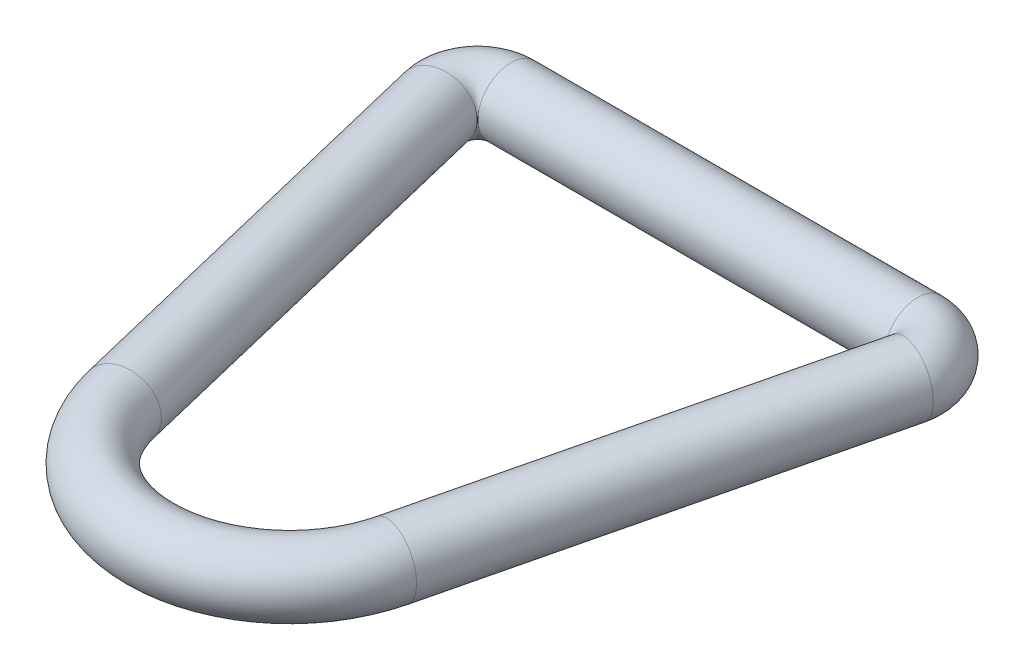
ISO-10303-21;
HEADER;
FILE_DESCRIPTION(('STEP AP214'),'2;1');
FILE_NAME('part.step','',(''),(''),'','','');
FILE_SCHEMA(('AUTOMOTIVE_DESIGN { 1 0 10303 214 1 1 1 1 }'));
ENDSEC;
DATA;
#1=APPLICATION_CONTEXT('core data for automotive mechanical design processes');
#2=APPLICATION_PROTOCOL_DEFINITION('international standard','automotive_design',2000,#1);
#3=PRODUCT_CONTEXT('',#1,'mechanical');
#4=PRODUCT('Part','Part','',(#3));
#5=PRODUCT_RELATED_PRODUCT_CATEGORY('part','',(#4));
#6=PRODUCT_DEFINITION_FORMATION('','',#4);
#7=PRODUCT_DEFINITION_CONTEXT('part definition',#1,'design');
#8=PRODUCT_DEFINITION('design','',#6,#7);
#9=PRODUCT_DEFINITION_SHAPE('','',#8);
#10=(LENGTH_UNIT() NAMED_UNIT(*) SI_UNIT(.MILLI.,.METRE.));
#11=(NAMED_UNIT(*) PLANE_ANGLE_UNIT() SI_UNIT($,.RADIAN.));
#12=(NAMED_UNIT(*) SI_UNIT($,.STERADIAN.) SOLID_ANGLE_UNIT());
#13=UNCERTAINTY_MEASURE_WITH_UNIT(LENGTH_MEASURE(1.E-05),#10,'distance_accuracy_value','');
#14=(GEOMETRIC_REPRESENTATION_CONTEXT(3) GLOBAL_UNCERTAINTY_ASSIGNED_CONTEXT((#13)) GLOBAL_UNIT_ASSIGNED_CONTEXT((#10,
#11,#12)) REPRESENTATION_CONTEXT('',''));
#15=CARTESIAN_POINT('',(0.,0.,0.));
#16=DIRECTION('',(0.,0.,1.));
#17=DIRECTION('',(1.,0.,0.));
#18=AXIS2_PLACEMENT_3D('',#15,#16,#17);
#19=CARTESIAN_POINT('',(24.3187242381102,0.,4.));
#20=DIRECTION('',(0.,1.,0.));
#21=DIRECTION('',(0.,0.,1.));
#22=AXIS2_PLACEMENT_3D('',#19,#20,#21);
#23=TOROIDAL_SURFACE('',#22,4.,3.95);
#24=CARTESIAN_POINT('',(28.2068949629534,0.,4.9392169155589));
#25=DIRECTION('',(-0.234804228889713,0.,0.972042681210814));
#26=DIRECTION('',(0.,-1.,0.));
#27=AXIS2_PLACEMENT_3D('',#24,#25,#26);
#28=CIRCLE('',#27,3.95);
#29=CARTESIAN_POINT('',(32.0464635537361,0.,5.86669361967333));
#30=VERTEX_POINT('',#29);
#31=EDGE_CURVE('E18',#30,#30,#28,.T.);
#32=CARTESIAN_POINT('',(24.3187242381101,0.,0.));
#33=DIRECTION('',(1.,0.,0.));
#34=DIRECTION('',(0.,-1.,0.));
#35=AXIS2_PLACEMENT_3D('',#32,#33,#34);
#36=CIRCLE('',#35,3.95);
#37=CARTESIAN_POINT('',(24.3187242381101,0.,-3.95));
#38=VERTEX_POINT('',#37);
#39=EDGE_CURVE('E8',#38,#38,#36,.T.);
#40=CARTESIAN_POINT('',(24.3187242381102,0.,4.));
#41=DIRECTION('',(0.,1.,0.));
#42=DIRECTION('',(0.,0.,1.));
#43=AXIS2_PLACEMENT_3D('',#40,#41,#42);
#44=CIRCLE('',#43,7.95);
#45=EDGE_CURVE('',#30,#38,#44,.T.);
#46=ORIENTED_EDGE('',*,*,#31,.F.);
#47=ORIENTED_EDGE('',*,*,#39,.T.);
#48=ORIENTED_EDGE('',*,*,#45,.T.);
#49=ORIENTED_EDGE('',*,*,#45,.F.);
#50=EDGE_LOOP('',(#46,#48,#47,#49));
#51=FACE_BOUND('',#50,.T.);
#52=ADVANCED_FACE('F12',(#51),#23,.T.);
#53=CARTESIAN_POINT('',(16.18451064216,0.,54.7094904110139));
#54=DIRECTION('',(0.234804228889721,0.,-0.972042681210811));
#55=DIRECTION('',(0.972042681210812,0.,0.234804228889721));
#56=AXIS2_PLACEMENT_3D('',#53,#54,#55);
#57=CYLINDRICAL_SURFACE('',#56,3.95);
#58=CARTESIAN_POINT('',(16.18451064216,0.,54.7094904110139));
#59=DIRECTION('',(-0.234804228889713,0.,0.972042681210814));
#60=DIRECTION('',(0.,-1.,0.));
#61=AXIS2_PLACEMENT_3D('',#58,#59,#60);
#62=CIRCLE('',#61,3.95);
#63=CARTESIAN_POINT('',(20.0240792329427,0.,55.6369671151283));
#64=VERTEX_POINT('',#63);
#65=EDGE_CURVE('E22',#64,#64,#62,.T.);
#66=ORIENTED_EDGE('',*,*,#65,.F.);
#67=EDGE_LOOP('',(#66));
#68=FACE_BOUND('',#67,.T.);
#69=ORIENTED_EDGE('',*,*,#31,.T.);
#70=EDGE_LOOP('',(#69));
#71=FACE_BOUND('',#70,.T.);
#72=ADVANCED_FACE('F55',(#68,#71),#57,.T.);
#73=CARTESIAN_POINT('',(0.,0.,50.8));
#74=DIRECTION('',(0.,1.,0.));
#75=DIRECTION('',(0.,0.,1.));
#76=AXIS2_PLACEMENT_3D('',#73,#74,#75);
#77=TOROIDAL_SURFACE('',#76,16.65,3.95);
#78=CARTESIAN_POINT('',(-16.18451064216,0.,54.7094904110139));
#79=DIRECTION('',(-0.234804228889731,0.,-0.972042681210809));
#80=DIRECTION('',(0.,-1.,0.));
#81=AXIS2_PLACEMENT_3D('',#78,#79,#80);
#82=CIRCLE('',#81,3.95);
#83=CARTESIAN_POINT('',(-20.0240792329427,0.,55.6369671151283));
#84=VERTEX_POINT('',#83);
#85=EDGE_CURVE('E26',#84,#84,#82,.T.);
#86=CARTESIAN_POINT('',(0.,0.,50.8));
#87=DIRECTION('',(0.,1.,0.));
#88=DIRECTION('',(0.,0.,1.));
#89=AXIS2_PLACEMENT_3D('',#86,#87,#88);
#90=CIRCLE('',#89,20.6);
#91=EDGE_CURVE('',#84,#64,#90,.T.);
#92=ORIENTED_EDGE('',*,*,#85,.F.);
#93=ORIENTED_EDGE('',*,*,#65,.T.);
#94=ORIENTED_EDGE('',*,*,#91,.T.);
#95=ORIENTED_EDGE('',*,*,#91,.F.);
#96=EDGE_LOOP('',(#92,#94,#93,#95));
#97=FACE_BOUND('',#96,.T.);
#98=ADVANCED_FACE('F49',(#97),#77,.T.);
#99=CARTESIAN_POINT('',(-28.2068949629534,0.,4.9392169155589));
#100=DIRECTION('',(0.234804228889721,0.,0.972042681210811));
#101=DIRECTION('',(-0.972042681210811,0.,0.234804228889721));
#102=AXIS2_PLACEMENT_3D('',#99,#100,#101);
#103=CYLINDRICAL_SURFACE('',#102,3.95);
#104=CARTESIAN_POINT('',(-28.2068949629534,0.,4.9392169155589));
#105=DIRECTION('',(-0.234804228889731,0.,-0.972042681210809));
#106=DIRECTION('',(0.,-1.,0.));
#107=AXIS2_PLACEMENT_3D('',#104,#105,#106);
#108=CIRCLE('',#107,3.95);
#109=CARTESIAN_POINT('',(-32.0464635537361,0.,5.86669361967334));
#110=VERTEX_POINT('',#109);
#111=EDGE_CURVE('E31',#110,#110,#108,.T.);
#112=CARTESIAN_POINT('',(-32.0464635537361,0.,5.86669361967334));
#113=CARTESIAN_POINT('',(-31.9212303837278,0.,6.38513396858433));
#114=CARTESIAN_POINT('',(-31.7959972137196,0.,6.90357431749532));
#115=CARTESIAN_POINT('',(-31.545530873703,0.,7.94045501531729));
#116=CARTESIAN_POINT('',(-31.4202977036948,0.,8.45889536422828));
#117=CARTESIAN_POINT('',(-31.1698313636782,0.,9.49577606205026));
#118=CARTESIAN_POINT('',(-31.04459819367,0.,10.0142164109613));
#119=CARTESIAN_POINT('',(-30.7941318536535,0.,11.0510971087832));
#120=CARTESIAN_POINT('',(-30.6688986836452,0.,11.5695374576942));
#121=CARTESIAN_POINT('',(-30.4184323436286,0.,12.6064181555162));
#122=CARTESIAN_POINT('',(-30.2931991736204,0.,13.1248585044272));
#123=CARTESIAN_POINT('',(-30.0427328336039,0.,14.1617392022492));
#124=CARTESIAN_POINT('',(-29.9174996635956,0.,14.6801795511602));
#125=CARTESIAN_POINT('',(-29.6670333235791,0.,15.7170602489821));
#126=CARTESIAN_POINT('',(-29.5418001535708,0.,16.2355005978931));
#127=CARTESIAN_POINT('',(-29.2913338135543,0.,17.2723812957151));
#128=CARTESIAN_POINT('',(-29.166100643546,0.,17.7908216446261));
#129=CARTESIAN_POINT('',(-28.9156343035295,0.,18.8277023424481));
#130=CARTESIAN_POINT('',(-28.7904011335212,0.,19.3461426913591));
#131=CARTESIAN_POINT('',(-28.5399347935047,0.,20.383023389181));
#132=CARTESIAN_POINT('',(-28.4147016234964,0.,20.901463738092));
#133=CARTESIAN_POINT('',(-28.1642352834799,0.,21.938344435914));
#134=CARTESIAN_POINT('',(-28.0390021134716,0.,22.456784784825));
#135=CARTESIAN_POINT('',(-27.7885357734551,0.,23.493665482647));
#136=CARTESIAN_POINT('',(-27.6633026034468,0.,24.012105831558));
#137=CARTESIAN_POINT('',(-27.4128362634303,0.,25.0489865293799));
#138=CARTESIAN_POINT('',(-27.287603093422,0.,25.5674268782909));
#139=CARTESIAN_POINT('',(-27.0371367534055,0.,26.6043075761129));
#140=CARTESIAN_POINT('',(-26.9119035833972,0.,27.1227479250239));
#141=CARTESIAN_POINT('',(-26.6614372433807,0.,28.1596286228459));
#142=CARTESIAN_POINT('',(-26.5362040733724,0.,28.6780689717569));
#143=CARTESIAN_POINT('',(-26.2857377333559,0.,29.7149496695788));
#144=CARTESIAN_POINT('',(-26.1605045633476,0.,30.2333900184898));
#145=CARTESIAN_POINT('',(-25.9100382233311,0.,31.2702707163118));
#146=CARTESIAN_POINT('',(-25.7848050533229,0.,31.7887110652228));
#147=CARTESIAN_POINT('',(-25.5343387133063,0.,32.8255917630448));
#148=CARTESIAN_POINT('',(-25.4091055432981,0.,33.3440321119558));
#149=CARTESIAN_POINT('',(-25.1586392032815,0.,34.3809128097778));
#150=CARTESIAN_POINT('',(-25.0334060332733,0.,34.8993531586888));
#151=CARTESIAN_POINT('',(-24.7829396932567,0.,35.9362338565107));
#152=CARTESIAN_POINT('',(-24.6577065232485,0.,36.4546742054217));
#153=CARTESIAN_POINT('',(-24.4072401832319,0.,37.4915549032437));
#154=CARTESIAN_POINT('',(-24.2820070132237,0.,38.0099952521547));
#155=CARTESIAN_POINT('',(-24.0315406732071,0.,39.0468759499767));
#156=CARTESIAN_POINT('',(-23.9063075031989,0.,39.5653162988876));
#157=CARTESIAN_POINT('',(-23.6558411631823,0.,40.6021969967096));
#158=CARTESIAN_POINT('',(-23.5306079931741,0.,41.1206373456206));
#159=CARTESIAN_POINT('',(-23.2801416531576,0.,42.1575180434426));
#160=CARTESIAN_POINT('',(-23.1549084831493,0.,42.6759583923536));
#161=CARTESIAN_POINT('',(-22.9044421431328,0.,43.7128390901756));
#162=CARTESIAN_POINT('',(-22.7792089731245,0.,44.2312794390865));
#163=CARTESIAN_POINT('',(-22.528742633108,0.,45.2681601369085));
#164=CARTESIAN_POINT('',(-22.4035094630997,0.,45.7866004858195));
#165=CARTESIAN_POINT('',(-22.1530431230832,0.,46.8234811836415));
#166=CARTESIAN_POINT('',(-22.0278099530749,0.,47.3419215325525));
#167=CARTESIAN_POINT('',(-21.7773436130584,0.,48.3788022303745));
#168=CARTESIAN_POINT('',(-21.6521104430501,0.,48.8972425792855));
#169=CARTESIAN_POINT('',(-21.4016441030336,0.,49.9341232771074));
#170=CARTESIAN_POINT('',(-21.2764109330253,0.,50.4525636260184));
#171=CARTESIAN_POINT('',(-21.0259445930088,0.,51.4894443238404));
#172=CARTESIAN_POINT('',(-20.9007114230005,0.,52.0078846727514));
#173=CARTESIAN_POINT('',(-20.650245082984,0.,53.0447653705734));
#174=CARTESIAN_POINT('',(-20.5250119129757,0.,53.5632057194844));
#175=CARTESIAN_POINT('',(-20.2745455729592,0.,54.6000864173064));
#176=CARTESIAN_POINT('',(-20.1493124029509,0.,55.1185267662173));
#177=CARTESIAN_POINT('',(-20.0240792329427,0.,55.6369671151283));
#178=B_SPLINE_CURVE_WITH_KNOTS('',3,(#112,#113,#114,#115,#116,#117,#118,#119,#120,#121,#122,
#123,#124,#125,#126,#127,#128,#129,#130,#131,#132,#133,#134,#135,#136,#137,#138,#139,#140,#141,
#142,#143,#144,#145,#146,#147,#148,#149,#150,#151,#152,#153,#154,#155,#156,#157,#158,#159,#160,
#161,#162,#163,#164,#165,#166,#167,#168,#169,#170,#171,#172,#173,#174,#175,#176,#177),
.UNSPECIFIED.,.F.,.F.,(4,2,2,2,2,2,2,2,2,2,2,2,2,2,2,2,2,2,2,2,2,2,2,2,2,2,2,2,2,2,2,2,4),(0.,
1.60005427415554,3.20010854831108,4.80016282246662,6.40021709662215,8.00027137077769,
9.60032564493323,11.2003799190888,12.8004341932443,14.4004884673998,16.0005427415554,
17.6005970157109,19.2006512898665,20.800705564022,22.4007598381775,24.0008141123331,
25.6008683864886,27.2009226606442,28.8009769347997,30.4010312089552,32.0010854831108,
33.6011397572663,35.2011940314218,36.8012483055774,38.4013025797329,40.0013568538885,
41.601411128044,43.2014654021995,44.8015196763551,46.4015739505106,48.0016282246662,
49.6016824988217,51.2017367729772),.UNSPECIFIED.);
#179=EDGE_CURVE('BSEAM43',#110,#84,#178,.T.);
#180=ORIENTED_EDGE('',*,*,#111,.F.);
#181=ORIENTED_EDGE('',*,*,#85,.T.);
#182=ORIENTED_EDGE('',*,*,#179,.T.);
#183=ORIENTED_EDGE('',*,*,#179,.F.);
#184=EDGE_LOOP('',(#180,#182,#181,#183));
#185=FACE_BOUND('',#184,.T.);
#186=ADVANCED_FACE('F43',(#185),#103,.T.);
#187=CARTESIAN_POINT('',(-24.3187242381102,0.,4.));
#188=DIRECTION('',(0.,1.,0.));
#189=DIRECTION('',(0.,0.,1.));
#190=AXIS2_PLACEMENT_3D('',#187,#188,#189);
#191=TOROIDAL_SURFACE('',#190,4.,3.95);
#192=CARTESIAN_POINT('',(-24.3187242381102,0.,0.));
#193=DIRECTION('',(1.,0.,0.));
#194=DIRECTION('',(0.,-1.,0.));
#195=AXIS2_PLACEMENT_3D('',#192,#193,#194);
#196=CIRCLE('',#195,3.95);
#197=CARTESIAN_POINT('',(-24.3187242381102,0.,-3.95));
#198=VERTEX_POINT('',#197);
#199=EDGE_CURVE('E34',#198,#198,#196,.T.);
#200=CARTESIAN_POINT('',(-24.3187242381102,0.,4.));
#201=DIRECTION('',(0.,1.,0.));
#202=DIRECTION('',(0.,0.,1.));
#203=AXIS2_PLACEMENT_3D('',#200,#201,#202);
#204=CIRCLE('',#203,7.95);
#205=EDGE_CURVE('',#198,#110,#204,.T.);
#206=ORIENTED_EDGE('',*,*,#199,.F.);
#207=ORIENTED_EDGE('',*,*,#111,.T.);
#208=ORIENTED_EDGE('',*,*,#205,.T.);
#209=ORIENTED_EDGE('',*,*,#205,.F.);
#210=EDGE_LOOP('',(#206,#208,#207,#209));
#211=FACE_BOUND('',#210,.T.);
#212=ADVANCED_FACE('F40',(#211),#191,.T.);
#213=CARTESIAN_POINT('',(-24.3187242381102,0.,0.));
#214=DIRECTION('',(1.,0.,0.));
#215=DIRECTION('',(0.,0.,1.));
#216=AXIS2_PLACEMENT_3D('',#213,#214,#215);
#217=CYLINDRICAL_SURFACE('',#216,3.95);
#218=ORIENTED_EDGE('',*,*,#39,.F.);
#219=EDGE_LOOP('',(#218));
#220=FACE_BOUND('',#219,.T.);
#221=ORIENTED_EDGE('',*,*,#199,.T.);
#222=EDGE_LOOP('',(#221));
#223=FACE_BOUND('',#222,.T.);
#224=ADVANCED_FACE('F38',(#220,#223),#217,.T.);
#225=CLOSED_SHELL('',(#52,#72,#98,#186,#212,#224));
#226=MANIFOLD_SOLID_BREP('B1',#225);
#227=ADVANCED_BREP_SHAPE_REPRESENTATION('',(#18,#226),#14);
#228=SHAPE_DEFINITION_REPRESENTATION(#9,#227);
ENDSEC;
END-ISO-10303-21;
